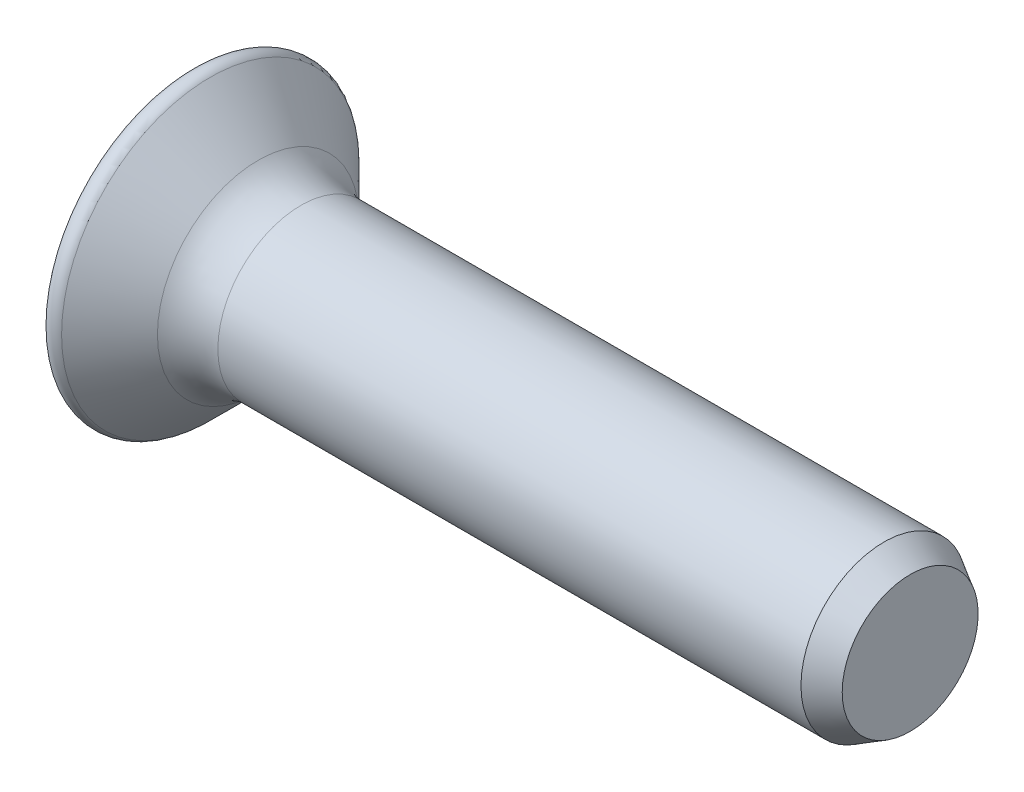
ISO-10303-21;
HEADER;
FILE_DESCRIPTION(('STEP AP214'),'2;1');
FILE_NAME('part.step','',(''),(''),'','','');
FILE_SCHEMA(('AUTOMOTIVE_DESIGN { 1 0 10303 214 1 1 1 1 }'));
ENDSEC;
DATA;
#1=APPLICATION_CONTEXT('core data for automotive mechanical design processes');
#2=APPLICATION_PROTOCOL_DEFINITION('international standard','automotive_design',2000,#1);
#3=PRODUCT_CONTEXT('',#1,'mechanical');
#4=PRODUCT('Part','Part','',(#3));
#5=PRODUCT_RELATED_PRODUCT_CATEGORY('part','',(#4));
#6=PRODUCT_DEFINITION_FORMATION('','',#4);
#7=PRODUCT_DEFINITION_CONTEXT('part definition',#1,'design');
#8=PRODUCT_DEFINITION('design','',#6,#7);
#9=PRODUCT_DEFINITION_SHAPE('','',#8);
#10=(LENGTH_UNIT() NAMED_UNIT(*) SI_UNIT(.MILLI.,.METRE.));
#11=(NAMED_UNIT(*) PLANE_ANGLE_UNIT() SI_UNIT($,.RADIAN.));
#12=(NAMED_UNIT(*) SI_UNIT($,.STERADIAN.) SOLID_ANGLE_UNIT());
#13=UNCERTAINTY_MEASURE_WITH_UNIT(LENGTH_MEASURE(1.E-05),#10,'distance_accuracy_value','');
#14=(GEOMETRIC_REPRESENTATION_CONTEXT(3) GLOBAL_UNCERTAINTY_ASSIGNED_CONTEXT((#13)) GLOBAL_UNIT_ASSIGNED_CONTEXT((#10,
#11,#12)) REPRESENTATION_CONTEXT('',''));
#15=CARTESIAN_POINT('',(0.,0.,0.));
#16=DIRECTION('',(0.,0.,1.));
#17=DIRECTION('',(1.,0.,0.));
#18=AXIS2_PLACEMENT_3D('',#15,#16,#17);
#19=CARTESIAN_POINT('',(2.4,0.,0.));
#20=DIRECTION('',(-1.,0.,0.));
#21=DIRECTION('',(0.,1.,0.));
#22=AXIS2_PLACEMENT_3D('',#19,#20,#21);
#23=SPHERICAL_SURFACE('',#22,4.);
#24=CARTESIAN_POINT('',(-1.1,0.,0.));
#25=DIRECTION('',(-1.,0.,0.));
#26=DIRECTION('',(0.,0.,1.));
#27=AXIS2_PLACEMENT_3D('',#24,#25,#26);
#28=CIRCLE('',#27,1.93649167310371);
#29=CARTESIAN_POINT('',(-1.1,0.,1.93649167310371));
#30=VERTEX_POINT('',#29);
#31=EDGE_CURVE('E187',#30,#30,#28,.T.);
#32=ORIENTED_EDGE('',*,*,#31,.T.);
#33=EDGE_LOOP('',(#32));
#34=FACE_BOUND('',#33,.T.);
#35=CARTESIAN_POINT('',(2.35629520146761,0.0815496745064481,0.407748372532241));
#36=DIRECTION('',(0.104528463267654,-0.195041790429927,-0.975208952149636));
#37=DIRECTION('',(0.,0.98058067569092,-0.196116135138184));
#38=AXIS2_PLACEMENT_3D('',#35,#36,#37);
#39=CIRCLE('',#38,3.97808758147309);
#40=CARTESIAN_POINT('',(-1.44518808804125,1.08372861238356,-0.200152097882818));
#41=VERTEX_POINT('',#40);
#42=CARTESIAN_POINT('',(-1.52998706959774,0.732056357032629,-0.138906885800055));
#43=VERTEX_POINT('',#42);
#44=EDGE_CURVE('E327',#41,#43,#39,.F.);
#45=ORIENTED_EDGE('',*,*,#44,.F.);
#46=CARTESIAN_POINT('',(2.47064663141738,0.672157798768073,0.));
#47=DIRECTION('',(0.104528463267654,0.994521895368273,0.));
#48=DIRECTION('',(-0.994521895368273,0.104528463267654,0.));
#49=AXIS2_PLACEMENT_3D('',#46,#47,#48);
#50=CIRCLE('',#49,3.94248816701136);
#51=CARTESIAN_POINT('',(-1.44518808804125,1.08372861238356,0.200152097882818));
#52=VERTEX_POINT('',#51);
#53=EDGE_CURVE('E56',#52,#41,#50,.F.);
#54=ORIENTED_EDGE('',*,*,#53,.F.);
#55=CARTESIAN_POINT('',(2.35629520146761,0.0815496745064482,-0.407748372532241));
#56=DIRECTION('',(0.104528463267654,-0.195041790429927,0.975208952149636));
#57=DIRECTION('',(0.,-0.98058067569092,-0.196116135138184));
#58=AXIS2_PLACEMENT_3D('',#55,#56,#57);
#59=CIRCLE('',#58,3.97808758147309);
#60=CARTESIAN_POINT('',(-1.52998706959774,0.732056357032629,0.138906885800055));
#61=VERTEX_POINT('',#60);
#62=EDGE_CURVE('E324',#61,#52,#59,.F.);
#63=ORIENTED_EDGE('',*,*,#62,.F.);
#64=CARTESIAN_POINT('',(2.40761651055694,0.0362331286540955,0.0627576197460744));
#65=DIRECTION('',(0.104528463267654,0.49726094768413,0.861281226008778));
#66=DIRECTION('',(0.,-0.866025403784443,0.499999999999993));
#67=AXIS2_PLACEMENT_3D('',#64,#65,#66);
#68=CIRCLE('',#67,3.99933627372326);
#69=CARTESIAN_POINT('',(-1.56766455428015,0.358913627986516,0.358913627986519));
#70=VERTEX_POINT('',#69);
#71=EDGE_CURVE('E322',#70,#61,#68,.F.);
#72=ORIENTED_EDGE('',*,*,#71,.F.);
#73=CARTESIAN_POINT('',(2.40761651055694,0.0627576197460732,0.0362331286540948));
#74=DIRECTION('',(0.104528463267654,0.861281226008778,0.497260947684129));
#75=DIRECTION('',(0.,-0.499999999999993,0.866025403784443));
#76=AXIS2_PLACEMENT_3D('',#73,#74,#75);
#77=CIRCLE('',#76,3.99933627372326);
#78=CARTESIAN_POINT('',(-1.52998706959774,0.138906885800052,0.732056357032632));
#79=VERTEX_POINT('',#78);
#80=EDGE_CURVE('E320',#79,#70,#77,.F.);
#81=ORIENTED_EDGE('',*,*,#80,.F.);
#82=CARTESIAN_POINT('',(2.35629520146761,-0.407748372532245,0.0815496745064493));
#83=DIRECTION('',(0.104528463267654,0.975208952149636,-0.195041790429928));
#84=DIRECTION('',(0.,0.196116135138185,0.98058067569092));
#85=AXIS2_PLACEMENT_3D('',#82,#83,#84);
#86=CIRCLE('',#85,3.97808758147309);
#87=CARTESIAN_POINT('',(-1.44518808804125,0.200152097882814,1.08372861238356));
#88=VERTEX_POINT('',#87);
#89=EDGE_CURVE('E318',#88,#79,#86,.F.);
#90=ORIENTED_EDGE('',*,*,#89,.F.);
#91=CARTESIAN_POINT('',(2.47064663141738,0.,0.672157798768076));
#92=DIRECTION('',(0.104528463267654,0.,0.994521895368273));
#93=DIRECTION('',(0.994521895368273,0.,-0.104528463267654));
#94=AXIS2_PLACEMENT_3D('',#91,#92,#93);
#95=CIRCLE('',#94,3.94248816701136);
#96=CARTESIAN_POINT('',(-1.44518808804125,-0.200152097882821,1.08372861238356));
#97=VERTEX_POINT('',#96);
#98=EDGE_CURVE('E316',#97,#88,#95,.F.);
#99=ORIENTED_EDGE('',*,*,#98,.F.);
#100=CARTESIAN_POINT('',(2.35629520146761,0.407748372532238,0.0815496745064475));
#101=DIRECTION('',(0.104528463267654,-0.975208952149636,-0.195041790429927));
#102=DIRECTION('',(0.,0.196116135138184,-0.98058067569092));
#103=AXIS2_PLACEMENT_3D('',#100,#101,#102);
#104=CIRCLE('',#103,3.97808758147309);
#105=CARTESIAN_POINT('',(-1.52998706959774,-0.138906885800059,0.732056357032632));
#106=VERTEX_POINT('',#105);
#107=EDGE_CURVE('E314',#106,#97,#104,.F.);
#108=ORIENTED_EDGE('',*,*,#107,.F.);
#109=CARTESIAN_POINT('',(2.40761651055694,-0.0627576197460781,0.0362331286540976));
#110=DIRECTION('',(0.104528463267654,-0.861281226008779,0.497260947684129));
#111=DIRECTION('',(0.,-0.499999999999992,-0.866025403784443));
#112=AXIS2_PLACEMENT_3D('',#109,#110,#111);
#113=CIRCLE('',#112,3.99933627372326);
#114=CARTESIAN_POINT('',(-1.56766455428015,-0.358913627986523,0.358913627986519));
#115=VERTEX_POINT('',#114);
#116=EDGE_CURVE('E312',#115,#106,#113,.F.);
#117=ORIENTED_EDGE('',*,*,#116,.F.);
#118=CARTESIAN_POINT('',(2.40761651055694,-0.0362331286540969,0.0627576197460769));
#119=DIRECTION('',(0.104528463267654,-0.497260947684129,0.861281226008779));
#120=DIRECTION('',(0.,-0.866025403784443,-0.499999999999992));
#121=AXIS2_PLACEMENT_3D('',#118,#119,#120);
#122=CIRCLE('',#121,3.99933627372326);
#123=CARTESIAN_POINT('',(-1.52998706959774,-0.732056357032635,0.138906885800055));
#124=VERTEX_POINT('',#123);
#125=EDGE_CURVE('E310',#124,#115,#122,.F.);
#126=ORIENTED_EDGE('',*,*,#125,.F.);
#127=CARTESIAN_POINT('',(2.35629520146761,-0.0815496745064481,-0.407748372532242));
#128=DIRECTION('',(0.104528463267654,0.195041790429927,0.975208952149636));
#129=DIRECTION('',(0.,-0.98058067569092,0.196116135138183));
#130=AXIS2_PLACEMENT_3D('',#127,#128,#129);
#131=CIRCLE('',#130,3.97808758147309);
#132=CARTESIAN_POINT('',(-1.44518808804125,-1.08372861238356,0.200152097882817));
#133=VERTEX_POINT('',#132);
#134=EDGE_CURVE('E308',#133,#124,#131,.F.);
#135=ORIENTED_EDGE('',*,*,#134,.F.);
#136=CARTESIAN_POINT('',(2.47064663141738,-0.672157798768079,0.));
#137=DIRECTION('',(0.104528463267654,-0.994521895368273,0.));
#138=DIRECTION('',(0.994521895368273,0.104528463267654,0.));
#139=AXIS2_PLACEMENT_3D('',#136,#137,#138);
#140=CIRCLE('',#139,3.94248816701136);
#141=CARTESIAN_POINT('',(-1.44518808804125,-1.08372861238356,-0.200152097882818));
#142=VERTEX_POINT('',#141);
#143=EDGE_CURVE('E306',#142,#133,#140,.F.);
#144=ORIENTED_EDGE('',*,*,#143,.F.);
#145=CARTESIAN_POINT('',(2.35629520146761,-0.0815496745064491,0.407748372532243));
#146=DIRECTION('',(0.104528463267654,0.195041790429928,-0.975208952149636));
#147=DIRECTION('',(0.,0.98058067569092,0.196116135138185));
#148=AXIS2_PLACEMENT_3D('',#145,#146,#147);
#149=CIRCLE('',#148,3.97808758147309);
#150=CARTESIAN_POINT('',(-1.52998706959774,-0.732056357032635,-0.138906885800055));
#151=VERTEX_POINT('',#150);
#152=EDGE_CURVE('E304',#151,#142,#149,.F.);
#153=ORIENTED_EDGE('',*,*,#152,.F.);
#154=CARTESIAN_POINT('',(2.40761651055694,-0.0362331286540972,-0.0627576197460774));
#155=DIRECTION('',(0.104528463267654,-0.497260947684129,-0.861281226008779));
#156=DIRECTION('',(0.,0.866025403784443,-0.499999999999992));
#157=AXIS2_PLACEMENT_3D('',#154,#155,#156);
#158=CIRCLE('',#157,3.99933627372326);
#159=CARTESIAN_POINT('',(-1.56766455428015,-0.358913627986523,-0.358913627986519));
#160=VERTEX_POINT('',#159);
#161=EDGE_CURVE('E302',#160,#151,#158,.F.);
#162=ORIENTED_EDGE('',*,*,#161,.F.);
#163=CARTESIAN_POINT('',(2.40761651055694,-0.0627576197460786,-0.036233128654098));
#164=DIRECTION('',(0.104528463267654,-0.861281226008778,-0.497260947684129));
#165=DIRECTION('',(0.,0.499999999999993,-0.866025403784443));
#166=AXIS2_PLACEMENT_3D('',#163,#164,#165);
#167=CIRCLE('',#166,3.99933627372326);
#168=CARTESIAN_POINT('',(-1.52998706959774,-0.138906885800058,-0.732056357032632));
#169=VERTEX_POINT('',#168);
#170=EDGE_CURVE('E300',#169,#160,#167,.F.);
#171=ORIENTED_EDGE('',*,*,#170,.F.);
#172=CARTESIAN_POINT('',(2.35629520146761,0.407748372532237,-0.0815496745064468));
#173=DIRECTION('',(0.104528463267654,-0.975208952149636,0.195041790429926));
#174=DIRECTION('',(0.,-0.196116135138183,-0.980580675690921));
#175=AXIS2_PLACEMENT_3D('',#172,#173,#174);
#176=CIRCLE('',#175,3.97808758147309);
#177=CARTESIAN_POINT('',(-1.44518808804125,-0.200152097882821,-1.08372861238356));
#178=VERTEX_POINT('',#177);
#179=EDGE_CURVE('E298',#178,#169,#176,.F.);
#180=ORIENTED_EDGE('',*,*,#179,.F.);
#181=CARTESIAN_POINT('',(2.47064663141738,0.,-0.672157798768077));
#182=DIRECTION('',(0.104528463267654,0.,-0.994521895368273));
#183=DIRECTION('',(-0.994521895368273,0.,-0.104528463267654));
#184=AXIS2_PLACEMENT_3D('',#181,#182,#183);
#185=CIRCLE('',#184,3.94248816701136);
#186=CARTESIAN_POINT('',(-1.44518808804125,0.200152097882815,-1.08372861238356));
#187=VERTEX_POINT('',#186);
#188=EDGE_CURVE('E296',#187,#178,#185,.F.);
#189=ORIENTED_EDGE('',*,*,#188,.F.);
#190=CARTESIAN_POINT('',(2.35629520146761,-0.407748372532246,-0.0815496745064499));
#191=DIRECTION('',(0.104528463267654,0.975208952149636,0.195041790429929));
#192=DIRECTION('',(0.,-0.196116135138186,0.98058067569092));
#193=AXIS2_PLACEMENT_3D('',#190,#191,#192);
#194=CIRCLE('',#193,3.97808758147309);
#195=CARTESIAN_POINT('',(-1.52998706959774,0.138906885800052,-0.732056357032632));
#196=VERTEX_POINT('',#195);
#197=EDGE_CURVE('E294',#196,#187,#194,.F.);
#198=ORIENTED_EDGE('',*,*,#197,.F.);
#199=CARTESIAN_POINT('',(2.40761651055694,0.0627576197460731,-0.0362331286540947));
#200=DIRECTION('',(0.104528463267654,0.861281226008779,-0.497260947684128));
#201=DIRECTION('',(0.,0.499999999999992,0.866025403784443));
#202=AXIS2_PLACEMENT_3D('',#199,#200,#201);
#203=CIRCLE('',#202,3.99933627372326);
#204=CARTESIAN_POINT('',(-1.56766455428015,0.358913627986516,-0.358913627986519));
#205=VERTEX_POINT('',#204);
#206=EDGE_CURVE('E292',#205,#196,#203,.F.);
#207=ORIENTED_EDGE('',*,*,#206,.F.);
#208=CARTESIAN_POINT('',(2.40761651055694,0.0362331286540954,-0.0627576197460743));
#209=DIRECTION('',(0.104528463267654,0.497260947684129,-0.861281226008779));
#210=DIRECTION('',(0.,0.866025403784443,0.499999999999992));
#211=AXIS2_PLACEMENT_3D('',#208,#209,#210);
#212=CIRCLE('',#211,3.99933627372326);
#213=EDGE_CURVE('E290',#43,#205,#212,.F.);
#214=ORIENTED_EDGE('',*,*,#213,.F.);
#215=EDGE_LOOP('',(#45,#54,#63,#72,#81,#90,#99,#108,#117,#126,#135,#144,#153,#162,#171,#180,
#189,#198,#207,#214));
#216=FACE_BOUND('',#215,.T.);
#217=ADVANCED_FACE('F33',(#34,#216),#23,.T.);
#218=CARTESIAN_POINT('',(-0.972266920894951,0.,0.));
#219=DIRECTION('',(-1.,0.,0.));
#220=DIRECTION('',(0.,0.,1.));
#221=AXIS2_PLACEMENT_3D('',#218,#219,#220);
#222=TOROIDAL_SURFACE('',#221,1.86581908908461,0.145980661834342);
#223=ORIENTED_EDGE('',*,*,#31,.F.);
#224=EDGE_LOOP('',(#223));
#225=FACE_BOUND('',#224,.T.);
#226=CARTESIAN_POINT('',(-0.869043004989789,0.,0.));
#227=DIRECTION('',(-1.,0.,0.));
#228=DIRECTION('',(0.,0.,1.));
#229=AXIS2_PLACEMENT_3D('',#226,#227,#228);
#230=CIRCLE('',#229,1.96904300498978);
#231=CARTESIAN_POINT('',(-0.869043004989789,0.,1.96904300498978));
#232=VERTEX_POINT('',#231);
#233=EDGE_CURVE('E191',#232,#232,#230,.T.);
#234=ORIENTED_EDGE('',*,*,#233,.T.);
#235=EDGE_LOOP('',(#234));
#236=FACE_BOUND('',#235,.T.);
#237=ADVANCED_FACE('F343',(#225,#236),#222,.T.);
#238=CARTESIAN_POINT('',(0.,0.,0.));
#239=DIRECTION('',(-1.,0.,0.));
#240=DIRECTION('',(0.,0.,1.));
#241=AXIS2_PLACEMENT_3D('',#238,#239,#240);
#242=CONICAL_SURFACE('',#241,1.1,0.785398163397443);
#243=CARTESIAN_POINT('',(-0.234314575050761,0.,0.));
#244=DIRECTION('',(-1.,0.,0.));
#245=DIRECTION('',(0.,0.,1.));
#246=AXIS2_PLACEMENT_3D('',#243,#244,#245);
#247=CIRCLE('',#246,1.33431457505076);
#248=CARTESIAN_POINT('',(-0.234314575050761,0.,1.33431457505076));
#249=VERTEX_POINT('',#248);
#250=EDGE_CURVE('E41',#249,#249,#247,.T.);
#251=ORIENTED_EDGE('',*,*,#250,.T.);
#252=EDGE_LOOP('',(#251));
#253=FACE_BOUND('',#252,.T.);
#254=ORIENTED_EDGE('',*,*,#233,.F.);
#255=EDGE_LOOP('',(#254));
#256=FACE_BOUND('',#255,.T.);
#257=ADVANCED_FACE('F331',(#253,#256),#242,.T.);
#258=CARTESIAN_POINT('',(0.,0.,0.));
#259=DIRECTION('',(-1.,0.,0.));
#260=DIRECTION('',(0.,0.,1.));
#261=AXIS2_PLACEMENT_3D('',#258,#259,#260);
#262=CYLINDRICAL_SURFACE('',#261,1.1);
#263=CARTESIAN_POINT('',(0.331370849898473,0.,0.));
#264=DIRECTION('',(-1.,0.,0.));
#265=DIRECTION('',(0.,0.,1.));
#266=AXIS2_PLACEMENT_3D('',#263,#264,#265);
#267=CIRCLE('',#266,1.1);
#268=CARTESIAN_POINT('',(0.331370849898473,0.,1.1));
#269=VERTEX_POINT('',#268);
#270=EDGE_CURVE('E11',#269,#269,#267,.F.);
#271=ORIENTED_EDGE('',*,*,#270,.T.);
#272=EDGE_LOOP('',(#271));
#273=FACE_BOUND('',#272,.T.);
#274=CARTESIAN_POINT('',(8.05358983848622,0.,0.));
#275=DIRECTION('',(-1.,0.,0.));
#276=DIRECTION('',(0.,0.,1.));
#277=AXIS2_PLACEMENT_3D('',#274,#275,#276);
#278=CIRCLE('',#277,1.1);
#279=CARTESIAN_POINT('',(8.05358983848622,0.,1.1));
#280=VERTEX_POINT('',#279);
#281=EDGE_CURVE('E284',#280,#280,#278,.T.);
#282=ORIENTED_EDGE('',*,*,#281,.T.);
#283=EDGE_LOOP('',(#282));
#284=FACE_BOUND('',#283,.T.);
#285=ADVANCED_FACE('F359',(#273,#284),#262,.T.);
#286=CARTESIAN_POINT('',(8.4,1.1,0.));
#287=DIRECTION('',(-1.,0.,0.));
#288=DIRECTION('',(0.,0.,1.));
#289=AXIS2_PLACEMENT_3D('',#286,#287,#288);
#290=PLANE('',#289);
#291=CARTESIAN_POINT('',(8.4,0.,0.));
#292=DIRECTION('',(-1.,0.,0.));
#293=DIRECTION('',(0.,0.,1.));
#294=AXIS2_PLACEMENT_3D('',#291,#292,#293);
#295=CIRCLE('',#294,0.899999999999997);
#296=CARTESIAN_POINT('',(8.4,0.,0.899999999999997));
#297=VERTEX_POINT('',#296);
#298=EDGE_CURVE('E287',#297,#297,#295,.F.);
#299=ORIENTED_EDGE('',*,*,#298,.T.);
#300=EDGE_LOOP('',(#299));
#301=FACE_BOUND('',#300,.T.);
#302=ADVANCED_FACE('F355',(#301),#290,.F.);
#303=CARTESIAN_POINT('',(8.05358983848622,0.,0.));
#304=DIRECTION('',(-1.,0.,0.));
#305=DIRECTION('',(0.,0.,1.));
#306=AXIS2_PLACEMENT_3D('',#303,#304,#305);
#307=CONICAL_SURFACE('',#306,1.1,0.523598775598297);
#308=ORIENTED_EDGE('',*,*,#298,.F.);
#309=EDGE_LOOP('',(#308));
#310=FACE_BOUND('',#309,.T.);
#311=ORIENTED_EDGE('',*,*,#281,.F.);
#312=EDGE_LOOP('',(#311));
#313=FACE_BOUND('',#312,.T.);
#314=ADVANCED_FACE('F358',(#310,#313),#307,.T.);
#315=CARTESIAN_POINT('',(-1.6,1.1,-0.22));
#316=DIRECTION('',(0.104528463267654,-0.195041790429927,-0.975208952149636));
#317=DIRECTION('',(0.,0.98058067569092,-0.196116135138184));
#318=AXIS2_PLACEMENT_3D('',#315,#316,#317);
#319=PLANE('',#318);
#320=ORIENTED_EDGE('',*,*,#44,.T.);
#321=DIRECTION('',(-0.993750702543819,0.0181251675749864,-0.110140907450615));
#322=VECTOR('',#321,1.);
#323=CARTESIAN_POINT('',(-1.6,0.733333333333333,-0.146666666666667));
#324=LINE('',#323,#322);
#325=CARTESIAN_POINT('',(-0.8,0.718742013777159,-0.0579998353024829));
#326=VERTEX_POINT('',#325);
#327=EDGE_CURVE('E48',#326,#43,#324,.T.);
#328=ORIENTED_EDGE('',*,*,#327,.F.);
#329=DIRECTION('',(0.,-0.98058067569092,0.196116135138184));
#330=VECTOR('',#329,1.);
#331=CARTESIAN_POINT('',(-0.8,0.0164901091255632,0.0824505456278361));
#332=LINE('',#331,#330);
#333=CARTESIAN_POINT('',(-0.8,1.01591661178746,-0.117434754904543));
#334=VERTEX_POINT('',#333);
#335=EDGE_CURVE('E176',#326,#334,#332,.F.);
#336=ORIENTED_EDGE('',*,*,#335,.T.);
#337=DIRECTION('',(-0.986535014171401,0.103689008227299,-0.126480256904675));
#338=VECTOR('',#337,1.);
#339=CARTESIAN_POINT('',(-1.54509803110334,1.09422957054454,-0.212961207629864));
#340=LINE('',#339,#338);
#341=EDGE_CURVE('E183',#334,#41,#340,.T.);
#342=ORIENTED_EDGE('',*,*,#341,.T.);
#343=EDGE_LOOP('',(#320,#328,#336,#342));
#344=FACE_BOUND('',#343,.T.);
#345=ADVANCED_FACE('F182',(#344),#319,.F.);
#346=CARTESIAN_POINT('',(-1.6,1.1,0.22));
#347=DIRECTION('',(0.104528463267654,0.994521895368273,0.));
#348=DIRECTION('',(-0.994521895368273,0.104528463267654,0.));
#349=AXIS2_PLACEMENT_3D('',#346,#347,#348);
#350=PLANE('',#349);
#351=ORIENTED_EDGE('',*,*,#53,.T.);
#352=ORIENTED_EDGE('',*,*,#341,.F.);
#353=DIRECTION('',(0.,0.,-1.));
#354=VECTOR('',#353,1.);
#355=CARTESIAN_POINT('',(-0.8,1.01591661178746,0.));
#356=LINE('',#355,#354);
#357=CARTESIAN_POINT('',(-0.8,1.01591661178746,0.117434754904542));
#358=VERTEX_POINT('',#357);
#359=EDGE_CURVE('E172',#334,#358,#356,.F.);
#360=ORIENTED_EDGE('',*,*,#359,.T.);
#361=DIRECTION('',(-0.986535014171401,0.103689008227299,0.126480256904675));
#362=VECTOR('',#361,1.);
#363=CARTESIAN_POINT('',(-1.6,1.1,0.22));
#364=LINE('',#363,#362);
#365=EDGE_CURVE('E188',#358,#52,#364,.T.);
#366=ORIENTED_EDGE('',*,*,#365,.T.);
#367=EDGE_LOOP('',(#351,#352,#360,#366));
#368=FACE_BOUND('',#367,.T.);
#369=ADVANCED_FACE('F186',(#368),#350,.F.);
#370=CARTESIAN_POINT('',(-1.6,1.1,0.22));
#371=DIRECTION('',(0.104528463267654,-0.195041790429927,0.975208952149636));
#372=DIRECTION('',(0.,-0.98058067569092,-0.196116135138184));
#373=AXIS2_PLACEMENT_3D('',#370,#371,#372);
#374=PLANE('',#373);
#375=ORIENTED_EDGE('',*,*,#62,.T.);
#376=ORIENTED_EDGE('',*,*,#365,.F.);
#377=DIRECTION('',(0.,0.98058067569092,0.196116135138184));
#378=VECTOR('',#377,1.);
#379=CARTESIAN_POINT('',(-0.8,0.0164901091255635,-0.0824505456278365));
#380=LINE('',#379,#378);
#381=CARTESIAN_POINT('',(-0.8,0.718742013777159,0.0579998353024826));
#382=VERTEX_POINT('',#381);
#383=EDGE_CURVE('E178',#358,#382,#380,.F.);
#384=ORIENTED_EDGE('',*,*,#383,.T.);
#385=DIRECTION('',(-0.993750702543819,0.0181251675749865,0.110140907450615));
#386=VECTOR('',#385,1.);
#387=CARTESIAN_POINT('',(-1.61463088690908,0.733600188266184,0.148288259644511));
#388=LINE('',#387,#386);
#389=EDGE_CURVE('E193',#382,#61,#388,.T.);
#390=ORIENTED_EDGE('',*,*,#389,.T.);
#391=EDGE_LOOP('',(#375,#376,#384,#390));
#392=FACE_BOUND('',#391,.T.);
#393=ADVANCED_FACE('F378',(#392),#374,.F.);
#394=CARTESIAN_POINT('',(-1.6,0.733333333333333,0.146666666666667));
#395=DIRECTION('',(0.104528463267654,0.49726094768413,0.861281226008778));
#396=DIRECTION('',(0.,-0.866025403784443,0.499999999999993));
#397=AXIS2_PLACEMENT_3D('',#394,#395,#396);
#398=PLANE('',#397);
#399=ORIENTED_EDGE('',*,*,#71,.T.);
#400=ORIENTED_EDGE('',*,*,#389,.F.);
#401=DIRECTION('',(0.,0.866025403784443,-0.499999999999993));
#402=VECTOR('',#401,1.);
#403=CARTESIAN_POINT('',(-0.8,0.204800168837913,0.354724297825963));
#404=LINE('',#403,#402);
#405=CARTESIAN_POINT('',(-0.8,0.29984825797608,0.299848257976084));
#406=VERTEX_POINT('',#405);
#407=EDGE_CURVE('E249',#382,#406,#404,.F.);
#408=ORIENTED_EDGE('',*,*,#407,.T.);
#409=DIRECTION('',(-0.994132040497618,0.0764901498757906,0.0764901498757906));
#410=VECTOR('',#409,1.);
#411=CARTESIAN_POINT('',(-1.61195345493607,0.362321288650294,0.362321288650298));
#412=LINE('',#411,#410);
#413=EDGE_CURVE('E243',#406,#70,#412,.T.);
#414=ORIENTED_EDGE('',*,*,#413,.T.);
#415=EDGE_LOOP('',(#399,#400,#408,#414));
#416=FACE_BOUND('',#415,.T.);
#417=ADVANCED_FACE('F441',(#416),#398,.F.);
#418=CARTESIAN_POINT('',(-1.6,0.146666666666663,0.733333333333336));
#419=DIRECTION('',(0.104528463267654,0.861281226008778,0.497260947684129));
#420=DIRECTION('',(0.,-0.499999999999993,0.866025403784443));
#421=AXIS2_PLACEMENT_3D('',#418,#419,#420);
#422=PLANE('',#421);
#423=ORIENTED_EDGE('',*,*,#80,.T.);
#424=ORIENTED_EDGE('',*,*,#413,.F.);
#425=DIRECTION('',(0.,0.499999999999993,-0.866025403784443));
#426=VECTOR('',#425,1.);
#427=CARTESIAN_POINT('',(-0.8,0.354724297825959,0.204800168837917));
#428=LINE('',#427,#426);
#429=CARTESIAN_POINT('',(-0.8,0.0579998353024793,0.718742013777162));
#430=VERTEX_POINT('',#429);
#431=EDGE_CURVE('E251',#406,#430,#428,.F.);
#432=ORIENTED_EDGE('',*,*,#431,.T.);
#433=DIRECTION('',(-0.993750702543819,0.110140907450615,0.0181251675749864));
#434=VECTOR('',#433,1.);
#435=CARTESIAN_POINT('',(-1.6,0.146666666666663,0.733333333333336));
#436=LINE('',#435,#434);
#437=EDGE_CURVE('E240',#430,#79,#436,.T.);
#438=ORIENTED_EDGE('',*,*,#437,.T.);
#439=EDGE_LOOP('',(#423,#424,#432,#438));
#440=FACE_BOUND('',#439,.T.);
#441=ADVANCED_FACE('F437',(#440),#422,.F.);
#442=CARTESIAN_POINT('',(-1.6,0.219999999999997,1.1));
#443=DIRECTION('',(0.104528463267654,0.975208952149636,-0.195041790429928));
#444=DIRECTION('',(0.,0.196116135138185,0.98058067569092));
#445=AXIS2_PLACEMENT_3D('',#442,#443,#444);
#446=PLANE('',#445);
#447=ORIENTED_EDGE('',*,*,#89,.T.);
#448=ORIENTED_EDGE('',*,*,#437,.F.);
#449=DIRECTION('',(0.,-0.196116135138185,-0.98058067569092));
#450=VECTOR('',#449,1.);
#451=CARTESIAN_POINT('',(-0.8,-0.0824505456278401,0.0164901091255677));
#452=LINE('',#451,#450);
#453=CARTESIAN_POINT('',(-0.8,0.117434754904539,1.01591661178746));
#454=VERTEX_POINT('',#453);
#455=EDGE_CURVE('E253',#430,#454,#452,.F.);
#456=ORIENTED_EDGE('',*,*,#455,.T.);
#457=DIRECTION('',(-0.986535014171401,0.126480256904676,0.103689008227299));
#458=VECTOR('',#457,1.);
#459=CARTESIAN_POINT('',(-1.54509803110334,0.212961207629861,1.09422957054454));
#460=LINE('',#459,#458);
#461=EDGE_CURVE('E237',#454,#88,#460,.T.);
#462=ORIENTED_EDGE('',*,*,#461,.T.);
#463=EDGE_LOOP('',(#447,#448,#456,#462));
#464=FACE_BOUND('',#463,.T.);
#465=ADVANCED_FACE('F433',(#464),#446,.F.);
#466=CARTESIAN_POINT('',(-1.6,-0.220000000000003,1.1));
#467=DIRECTION('',(0.104528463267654,0.,0.994521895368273));
#468=DIRECTION('',(0.994521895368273,0.,-0.104528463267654));
#469=AXIS2_PLACEMENT_3D('',#466,#467,#468);
#470=PLANE('',#469);
#471=ORIENTED_EDGE('',*,*,#98,.T.);
#472=ORIENTED_EDGE('',*,*,#461,.F.);
#473=DIRECTION('',(0.,1.,0.));
#474=VECTOR('',#473,1.);
#475=CARTESIAN_POINT('',(-0.8,0.,1.01591661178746));
#476=LINE('',#475,#474);
#477=CARTESIAN_POINT('',(-0.8,-0.117434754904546,1.01591661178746));
#478=VERTEX_POINT('',#477);
#479=EDGE_CURVE('E255',#454,#478,#476,.F.);
#480=ORIENTED_EDGE('',*,*,#479,.T.);
#481=DIRECTION('',(-0.986535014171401,-0.126480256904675,0.103689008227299));
#482=VECTOR('',#481,1.);
#483=CARTESIAN_POINT('',(-1.6,-0.220000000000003,1.1));
#484=LINE('',#483,#482);
#485=EDGE_CURVE('E234',#478,#97,#484,.T.);
#486=ORIENTED_EDGE('',*,*,#485,.T.);
#487=EDGE_LOOP('',(#471,#472,#480,#486));
#488=FACE_BOUND('',#487,.T.);
#489=ADVANCED_FACE('F429',(#488),#470,.F.);
#490=CARTESIAN_POINT('',(-1.6,-0.220000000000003,1.1));
#491=DIRECTION('',(0.104528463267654,-0.975208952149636,-0.195041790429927));
#492=DIRECTION('',(0.,0.196116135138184,-0.98058067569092));
#493=AXIS2_PLACEMENT_3D('',#490,#491,#492);
#494=PLANE('',#493);
#495=ORIENTED_EDGE('',*,*,#107,.T.);
#496=ORIENTED_EDGE('',*,*,#485,.F.);
#497=DIRECTION('',(0.,-0.196116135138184,0.98058067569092));
#498=VECTOR('',#497,1.);
#499=CARTESIAN_POINT('',(-0.8,0.0824505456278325,0.0164901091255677));
#500=LINE('',#499,#498);
#501=CARTESIAN_POINT('',(-0.8,-0.0579998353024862,0.718742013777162));
#502=VERTEX_POINT('',#501);
#503=EDGE_CURVE('E257',#478,#502,#500,.F.);
#504=ORIENTED_EDGE('',*,*,#503,.T.);
#505=DIRECTION('',(-0.993750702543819,-0.110140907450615,0.0181251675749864));
#506=VECTOR('',#505,1.);
#507=CARTESIAN_POINT('',(-1.61463088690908,-0.148288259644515,0.733600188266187));
#508=LINE('',#507,#506);
#509=EDGE_CURVE('E231',#502,#106,#508,.T.);
#510=ORIENTED_EDGE('',*,*,#509,.T.);
#511=EDGE_LOOP('',(#495,#496,#504,#510));
#512=FACE_BOUND('',#511,.T.);
#513=ADVANCED_FACE('F425',(#512),#494,.F.);
#514=CARTESIAN_POINT('',(-1.6,-0.14666666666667,0.733333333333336));
#515=DIRECTION('',(0.104528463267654,-0.861281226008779,0.497260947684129));
#516=DIRECTION('',(0.,-0.499999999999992,-0.866025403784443));
#517=AXIS2_PLACEMENT_3D('',#514,#515,#516);
#518=PLANE('',#517);
#519=ORIENTED_EDGE('',*,*,#116,.T.);
#520=ORIENTED_EDGE('',*,*,#509,.F.);
#521=DIRECTION('',(0.,0.499999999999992,0.866025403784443));
#522=VECTOR('',#521,1.);
#523=CARTESIAN_POINT('',(-0.8,-0.354724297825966,0.204800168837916));
#524=LINE('',#523,#522);
#525=CARTESIAN_POINT('',(-0.8,-0.299848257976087,0.299848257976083));
#526=VERTEX_POINT('',#525);
#527=EDGE_CURVE('E259',#502,#526,#524,.F.);
#528=ORIENTED_EDGE('',*,*,#527,.T.);
#529=DIRECTION('',(-0.994132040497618,-0.0764901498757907,0.0764901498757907));
#530=VECTOR('',#529,1.);
#531=CARTESIAN_POINT('',(-1.61195345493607,-0.362321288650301,0.362321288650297));
#532=LINE('',#531,#530);
#533=EDGE_CURVE('E228',#526,#115,#532,.T.);
#534=ORIENTED_EDGE('',*,*,#533,.T.);
#535=EDGE_LOOP('',(#519,#520,#528,#534));
#536=FACE_BOUND('',#535,.T.);
#537=ADVANCED_FACE('F421',(#536),#518,.F.);
#538=CARTESIAN_POINT('',(-1.6,-0.73333333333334,0.146666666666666));
#539=DIRECTION('',(0.104528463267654,-0.497260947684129,0.861281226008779));
#540=DIRECTION('',(0.,-0.866025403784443,-0.499999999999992));
#541=AXIS2_PLACEMENT_3D('',#538,#539,#540);
#542=PLANE('',#541);
#543=ORIENTED_EDGE('',*,*,#125,.T.);
#544=ORIENTED_EDGE('',*,*,#533,.F.);
#545=DIRECTION('',(0.,0.866025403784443,0.499999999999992));
#546=VECTOR('',#545,1.);
#547=CARTESIAN_POINT('',(-0.8,-0.20480016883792,0.354724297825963));
#548=LINE('',#547,#546);
#549=CARTESIAN_POINT('',(-0.8,-0.718742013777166,0.0579998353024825));
#550=VERTEX_POINT('',#549);
#551=EDGE_CURVE('E261',#526,#550,#548,.F.);
#552=ORIENTED_EDGE('',*,*,#551,.T.);
#553=DIRECTION('',(-0.993750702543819,-0.0181251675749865,0.110140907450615));
#554=VECTOR('',#553,1.);
#555=CARTESIAN_POINT('',(-1.6,-0.73333333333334,0.146666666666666));
#556=LINE('',#555,#554);
#557=EDGE_CURVE('E225',#550,#124,#556,.T.);
#558=ORIENTED_EDGE('',*,*,#557,.T.);
#559=EDGE_LOOP('',(#543,#544,#552,#558));
#560=FACE_BOUND('',#559,.T.);
#561=ADVANCED_FACE('F417',(#560),#542,.F.);
#562=CARTESIAN_POINT('',(-1.6,-1.10000000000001,0.219999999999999));
#563=DIRECTION('',(0.104528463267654,0.195041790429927,0.975208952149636));
#564=DIRECTION('',(0.,-0.98058067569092,0.196116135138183));
#565=AXIS2_PLACEMENT_3D('',#562,#563,#564);
#566=PLANE('',#565);
#567=ORIENTED_EDGE('',*,*,#134,.T.);
#568=ORIENTED_EDGE('',*,*,#557,.F.);
#569=DIRECTION('',(0.,0.98058067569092,-0.196116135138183));
#570=VECTOR('',#569,1.);
#571=CARTESIAN_POINT('',(-0.8,-0.0164901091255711,-0.082450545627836));
#572=LINE('',#571,#570);
#573=CARTESIAN_POINT('',(-0.8,-1.01591661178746,0.117434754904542));
#574=VERTEX_POINT('',#573);
#575=EDGE_CURVE('E263',#550,#574,#572,.F.);
#576=ORIENTED_EDGE('',*,*,#575,.T.);
#577=DIRECTION('',(-0.986535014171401,-0.103689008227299,0.126480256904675));
#578=VECTOR('',#577,1.);
#579=CARTESIAN_POINT('',(-1.54509803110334,-1.09422957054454,0.212961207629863));
#580=LINE('',#579,#578);
#581=EDGE_CURVE('E222',#574,#133,#580,.T.);
#582=ORIENTED_EDGE('',*,*,#581,.T.);
#583=EDGE_LOOP('',(#567,#568,#576,#582));
#584=FACE_BOUND('',#583,.T.);
#585=ADVANCED_FACE('F413',(#584),#566,.F.);
#586=CARTESIAN_POINT('',(-1.6,-1.10000000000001,-0.220000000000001));
#587=DIRECTION('',(0.104528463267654,-0.994521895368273,0.));
#588=DIRECTION('',(0.994521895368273,0.104528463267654,0.));
#589=AXIS2_PLACEMENT_3D('',#586,#587,#588);
#590=PLANE('',#589);
#591=ORIENTED_EDGE('',*,*,#143,.T.);
#592=ORIENTED_EDGE('',*,*,#581,.F.);
#593=DIRECTION('',(0.,0.,1.));
#594=VECTOR('',#593,1.);
#595=CARTESIAN_POINT('',(-0.8,-1.01591661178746,0.));
#596=LINE('',#595,#594);
#597=CARTESIAN_POINT('',(-0.8,-1.01591661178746,-0.117434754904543));
#598=VERTEX_POINT('',#597);
#599=EDGE_CURVE('E265',#574,#598,#596,.F.);
#600=ORIENTED_EDGE('',*,*,#599,.T.);
#601=DIRECTION('',(-0.986535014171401,-0.103689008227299,-0.126480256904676));
#602=VECTOR('',#601,1.);
#603=CARTESIAN_POINT('',(-1.6,-1.10000000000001,-0.220000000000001));
#604=LINE('',#603,#602);
#605=EDGE_CURVE('E219',#598,#142,#604,.T.);
#606=ORIENTED_EDGE('',*,*,#605,.T.);
#607=EDGE_LOOP('',(#591,#592,#600,#606));
#608=FACE_BOUND('',#607,.T.);
#609=ADVANCED_FACE('F409',(#608),#590,.F.);
#610=CARTESIAN_POINT('',(-1.6,-1.10000000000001,-0.220000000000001));
#611=DIRECTION('',(0.104528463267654,0.195041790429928,-0.975208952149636));
#612=DIRECTION('',(0.,0.98058067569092,0.196116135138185));
#613=AXIS2_PLACEMENT_3D('',#610,#611,#612);
#614=PLANE('',#613);
#615=ORIENTED_EDGE('',*,*,#152,.T.);
#616=ORIENTED_EDGE('',*,*,#605,.F.);
#617=DIRECTION('',(0.,-0.98058067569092,-0.196116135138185));
#618=VECTOR('',#617,1.);
#619=CARTESIAN_POINT('',(-0.8,-0.0164901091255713,0.0824505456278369));
#620=LINE('',#619,#618);
#621=CARTESIAN_POINT('',(-0.8,-0.718742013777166,-0.057999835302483));
#622=VERTEX_POINT('',#621);
#623=EDGE_CURVE('E267',#598,#622,#620,.F.);
#624=ORIENTED_EDGE('',*,*,#623,.T.);
#625=DIRECTION('',(-0.993750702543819,-0.0181251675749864,-0.110140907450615));
#626=VECTOR('',#625,1.);
#627=CARTESIAN_POINT('',(-1.61463088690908,-0.733600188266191,-0.148288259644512));
#628=LINE('',#627,#626);
#629=EDGE_CURVE('E216',#622,#151,#628,.T.);
#630=ORIENTED_EDGE('',*,*,#629,.T.);
#631=EDGE_LOOP('',(#615,#616,#624,#630));
#632=FACE_BOUND('',#631,.T.);
#633=ADVANCED_FACE('F405',(#632),#614,.F.);
#634=CARTESIAN_POINT('',(-1.6,-0.73333333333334,-0.146666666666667));
#635=DIRECTION('',(0.104528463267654,-0.497260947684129,-0.861281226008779));
#636=DIRECTION('',(0.,0.866025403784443,-0.499999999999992));
#637=AXIS2_PLACEMENT_3D('',#634,#635,#636);
#638=PLANE('',#637);
#639=ORIENTED_EDGE('',*,*,#161,.T.);
#640=ORIENTED_EDGE('',*,*,#629,.F.);
#641=DIRECTION('',(0.,-0.866025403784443,0.499999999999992));
#642=VECTOR('',#641,1.);
#643=CARTESIAN_POINT('',(-0.8,-0.204800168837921,-0.354724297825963));
#644=LINE('',#643,#642);
#645=CARTESIAN_POINT('',(-0.8,-0.299848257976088,-0.299848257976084));
#646=VERTEX_POINT('',#645);
#647=EDGE_CURVE('E269',#622,#646,#644,.F.);
#648=ORIENTED_EDGE('',*,*,#647,.T.);
#649=DIRECTION('',(-0.994132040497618,-0.0764901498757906,-0.0764901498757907));
#650=VECTOR('',#649,1.);
#651=CARTESIAN_POINT('',(-1.61195345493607,-0.362321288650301,-0.362321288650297));
#652=LINE('',#651,#650);
#653=EDGE_CURVE('E213',#646,#160,#652,.T.);
#654=ORIENTED_EDGE('',*,*,#653,.T.);
#655=EDGE_LOOP('',(#639,#640,#648,#654));
#656=FACE_BOUND('',#655,.T.);
#657=ADVANCED_FACE('F401',(#656),#638,.F.);
#658=CARTESIAN_POINT('',(-1.6,-0.14666666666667,-0.733333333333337));
#659=DIRECTION('',(0.104528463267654,-0.861281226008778,-0.497260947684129));
#660=DIRECTION('',(0.,0.499999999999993,-0.866025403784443));
#661=AXIS2_PLACEMENT_3D('',#658,#659,#660);
#662=PLANE('',#661);
#663=ORIENTED_EDGE('',*,*,#170,.T.);
#664=ORIENTED_EDGE('',*,*,#653,.F.);
#665=DIRECTION('',(0.,-0.499999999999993,0.866025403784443));
#666=VECTOR('',#665,1.);
#667=CARTESIAN_POINT('',(-0.8,-0.354724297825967,-0.204800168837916));
#668=LINE('',#667,#666);
#669=CARTESIAN_POINT('',(-0.8,-0.0579998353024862,-0.718742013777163));
#670=VERTEX_POINT('',#669);
#671=EDGE_CURVE('E271',#646,#670,#668,.F.);
#672=ORIENTED_EDGE('',*,*,#671,.T.);
#673=DIRECTION('',(-0.993750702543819,-0.110140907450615,-0.0181251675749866));
#674=VECTOR('',#673,1.);
#675=CARTESIAN_POINT('',(-1.6,-0.14666666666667,-0.733333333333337));
#676=LINE('',#675,#674);
#677=EDGE_CURVE('E210',#670,#169,#676,.T.);
#678=ORIENTED_EDGE('',*,*,#677,.T.);
#679=EDGE_LOOP('',(#663,#664,#672,#678));
#680=FACE_BOUND('',#679,.T.);
#681=ADVANCED_FACE('F397',(#680),#662,.F.);
#682=CARTESIAN_POINT('',(-1.6,-0.220000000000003,-1.1));
#683=DIRECTION('',(0.104528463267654,-0.975208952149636,0.195041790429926));
#684=DIRECTION('',(0.,-0.196116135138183,-0.980580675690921));
#685=AXIS2_PLACEMENT_3D('',#682,#683,#684);
#686=PLANE('',#685);
#687=ORIENTED_EDGE('',*,*,#179,.T.);
#688=ORIENTED_EDGE('',*,*,#677,.F.);
#689=DIRECTION('',(0.,0.196116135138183,0.980580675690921));
#690=VECTOR('',#689,1.);
#691=CARTESIAN_POINT('',(-0.8,0.0824505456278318,-0.0164901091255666));
#692=LINE('',#691,#690);
#693=CARTESIAN_POINT('',(-0.8,-0.117434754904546,-1.01591661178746));
#694=VERTEX_POINT('',#693);
#695=EDGE_CURVE('E273',#670,#694,#692,.F.);
#696=ORIENTED_EDGE('',*,*,#695,.T.);
#697=DIRECTION('',(-0.986535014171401,-0.126480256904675,-0.103689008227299));
#698=VECTOR('',#697,1.);
#699=CARTESIAN_POINT('',(-1.54509803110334,-0.212961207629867,-1.09422957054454));
#700=LINE('',#699,#698);
#701=EDGE_CURVE('E207',#694,#178,#700,.T.);
#702=ORIENTED_EDGE('',*,*,#701,.T.);
#703=EDGE_LOOP('',(#687,#688,#696,#702));
#704=FACE_BOUND('',#703,.T.);
#705=ADVANCED_FACE('F393',(#704),#686,.F.);
#706=CARTESIAN_POINT('',(-1.6,0.219999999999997,-1.1));
#707=DIRECTION('',(0.104528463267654,0.,-0.994521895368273));
#708=DIRECTION('',(-0.994521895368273,0.,-0.104528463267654));
#709=AXIS2_PLACEMENT_3D('',#706,#707,#708);
#710=PLANE('',#709);
#711=ORIENTED_EDGE('',*,*,#188,.T.);
#712=ORIENTED_EDGE('',*,*,#701,.F.);
#713=DIRECTION('',(0.,-1.,0.));
#714=VECTOR('',#713,1.);
#715=CARTESIAN_POINT('',(-0.8,0.,-1.01591661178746));
#716=LINE('',#715,#714);
#717=CARTESIAN_POINT('',(-0.8,0.11743475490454,-1.01591661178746));
#718=VERTEX_POINT('',#717);
#719=EDGE_CURVE('E275',#694,#718,#716,.F.);
#720=ORIENTED_EDGE('',*,*,#719,.T.);
#721=DIRECTION('',(-0.986535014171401,0.126480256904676,-0.103689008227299));
#722=VECTOR('',#721,1.);
#723=CARTESIAN_POINT('',(-1.6,0.219999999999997,-1.1));
#724=LINE('',#723,#722);
#725=EDGE_CURVE('E204',#718,#187,#724,.T.);
#726=ORIENTED_EDGE('',*,*,#725,.T.);
#727=EDGE_LOOP('',(#711,#712,#720,#726));
#728=FACE_BOUND('',#727,.T.);
#729=ADVANCED_FACE('F389',(#728),#710,.F.);
#730=CARTESIAN_POINT('',(-1.6,0.219999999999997,-1.1));
#731=DIRECTION('',(0.104528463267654,0.975208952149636,0.195041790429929));
#732=DIRECTION('',(0.,-0.196116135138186,0.98058067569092));
#733=AXIS2_PLACEMENT_3D('',#730,#731,#732);
#734=PLANE('',#733);
#735=ORIENTED_EDGE('',*,*,#197,.T.);
#736=ORIENTED_EDGE('',*,*,#725,.F.);
#737=DIRECTION('',(0.,0.196116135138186,-0.98058067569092));
#738=VECTOR('',#737,1.);
#739=CARTESIAN_POINT('',(-0.8,-0.082450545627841,-0.0164901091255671));
#740=LINE('',#739,#738);
#741=CARTESIAN_POINT('',(-0.8,0.0579998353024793,-0.718742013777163));
#742=VERTEX_POINT('',#741);
#743=EDGE_CURVE('E277',#718,#742,#740,.F.);
#744=ORIENTED_EDGE('',*,*,#743,.T.);
#745=DIRECTION('',(-0.993750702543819,0.110140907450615,-0.0181251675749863));
#746=VECTOR('',#745,1.);
#747=CARTESIAN_POINT('',(-1.61463088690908,0.148288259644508,-0.733600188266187));
#748=LINE('',#747,#746);
#749=EDGE_CURVE('E201',#742,#196,#748,.T.);
#750=ORIENTED_EDGE('',*,*,#749,.T.);
#751=EDGE_LOOP('',(#735,#736,#744,#750));
#752=FACE_BOUND('',#751,.T.);
#753=ADVANCED_FACE('F385',(#752),#734,.F.);
#754=CARTESIAN_POINT('',(-1.6,0.146666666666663,-0.733333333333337));
#755=DIRECTION('',(0.104528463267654,0.861281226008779,-0.497260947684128));
#756=DIRECTION('',(0.,0.499999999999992,0.866025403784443));
#757=AXIS2_PLACEMENT_3D('',#754,#755,#756);
#758=PLANE('',#757);
#759=ORIENTED_EDGE('',*,*,#206,.T.);
#760=ORIENTED_EDGE('',*,*,#749,.F.);
#761=DIRECTION('',(0.,-0.499999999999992,-0.866025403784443));
#762=VECTOR('',#761,1.);
#763=CARTESIAN_POINT('',(-0.8,0.35472429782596,-0.204800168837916));
#764=LINE('',#763,#762);
#765=CARTESIAN_POINT('',(-0.8,0.29984825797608,-0.299848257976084));
#766=VERTEX_POINT('',#765);
#767=EDGE_CURVE('E279',#742,#766,#764,.F.);
#768=ORIENTED_EDGE('',*,*,#767,.T.);
#769=DIRECTION('',(-0.994132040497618,0.0764901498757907,-0.0764901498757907));
#770=VECTOR('',#769,1.);
#771=CARTESIAN_POINT('',(-1.61195345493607,0.362321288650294,-0.362321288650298));
#772=LINE('',#771,#770);
#773=EDGE_CURVE('E197',#766,#205,#772,.T.);
#774=ORIENTED_EDGE('',*,*,#773,.T.);
#775=EDGE_LOOP('',(#759,#760,#768,#774));
#776=FACE_BOUND('',#775,.T.);
#777=ADVANCED_FACE('F382',(#776),#758,.F.);
#778=CARTESIAN_POINT('',(-1.6,0.733333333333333,-0.146666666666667));
#779=DIRECTION('',(0.104528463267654,0.497260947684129,-0.861281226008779));
#780=DIRECTION('',(0.,0.866025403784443,0.499999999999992));
#781=AXIS2_PLACEMENT_3D('',#778,#779,#780);
#782=PLANE('',#781);
#783=ORIENTED_EDGE('',*,*,#213,.T.);
#784=ORIENTED_EDGE('',*,*,#773,.F.);
#785=DIRECTION('',(0.,-0.866025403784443,-0.499999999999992));
#786=VECTOR('',#785,1.);
#787=CARTESIAN_POINT('',(-0.8,0.204800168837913,-0.354724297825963));
#788=LINE('',#787,#786);
#789=EDGE_CURVE('E198',#766,#326,#788,.F.);
#790=ORIENTED_EDGE('',*,*,#789,.T.);
#791=ORIENTED_EDGE('',*,*,#327,.T.);
#792=EDGE_LOOP('',(#783,#784,#790,#791));
#793=FACE_BOUND('',#792,.T.);
#794=ADVANCED_FACE('F339',(#793),#782,.F.);
#795=CARTESIAN_POINT('',(-0.8,0.,0.));
#796=DIRECTION('',(-1.,0.,0.));
#797=DIRECTION('',(0.,0.,1.));
#798=AXIS2_PLACEMENT_3D('',#795,#796,#797);
#799=PLANE('',#798);
#800=ORIENTED_EDGE('',*,*,#335,.F.);
#801=ORIENTED_EDGE('',*,*,#789,.F.);
#802=ORIENTED_EDGE('',*,*,#767,.F.);
#803=ORIENTED_EDGE('',*,*,#743,.F.);
#804=ORIENTED_EDGE('',*,*,#719,.F.);
#805=ORIENTED_EDGE('',*,*,#695,.F.);
#806=ORIENTED_EDGE('',*,*,#671,.F.);
#807=ORIENTED_EDGE('',*,*,#647,.F.);
#808=ORIENTED_EDGE('',*,*,#623,.F.);
#809=ORIENTED_EDGE('',*,*,#599,.F.);
#810=ORIENTED_EDGE('',*,*,#575,.F.);
#811=ORIENTED_EDGE('',*,*,#551,.F.);
#812=ORIENTED_EDGE('',*,*,#527,.F.);
#813=ORIENTED_EDGE('',*,*,#503,.F.);
#814=ORIENTED_EDGE('',*,*,#479,.F.);
#815=ORIENTED_EDGE('',*,*,#455,.F.);
#816=ORIENTED_EDGE('',*,*,#431,.F.);
#817=ORIENTED_EDGE('',*,*,#407,.F.);
#818=ORIENTED_EDGE('',*,*,#383,.F.);
#819=ORIENTED_EDGE('',*,*,#359,.F.);
#820=EDGE_LOOP('',(#800,#801,#802,#803,#804,#805,#806,#807,#808,#809,#810,#811,#812,#813,#814,
#815,#816,#817,#818,#819));
#821=FACE_BOUND('',#820,.T.);
#822=ADVANCED_FACE('F174',(#821),#799,.T.);
#823=CARTESIAN_POINT('',(0.331370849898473,0.,0.));
#824=DIRECTION('',(-1.,0.,0.));
#825=DIRECTION('',(0.,0.,1.));
#826=AXIS2_PLACEMENT_3D('',#823,#824,#825);
#827=TOROIDAL_SURFACE('',#826,1.9,0.8);
#828=ORIENTED_EDGE('',*,*,#270,.F.);
#829=EDGE_LOOP('',(#828));
#830=FACE_BOUND('',#829,.T.);
#831=ORIENTED_EDGE('',*,*,#250,.F.);
#832=EDGE_LOOP('',(#831));
#833=FACE_BOUND('',#832,.T.);
#834=ADVANCED_FACE('F35',(#830,#833),#827,.F.);
#835=CLOSED_SHELL('',(#217,#237,#257,#285,#302,#314,#345,#369,#393,#417,#441,#465,#489,#513,
#537,#561,#585,#609,#633,#657,#681,#705,#729,#753,#777,#794,#822,#834));
#836=MANIFOLD_SOLID_BREP('B2',#835);
#837=ADVANCED_BREP_SHAPE_REPRESENTATION('',(#18,#836),#14);
#838=SHAPE_DEFINITION_REPRESENTATION(#9,#837);
ENDSEC;
END-ISO-10303-21;
